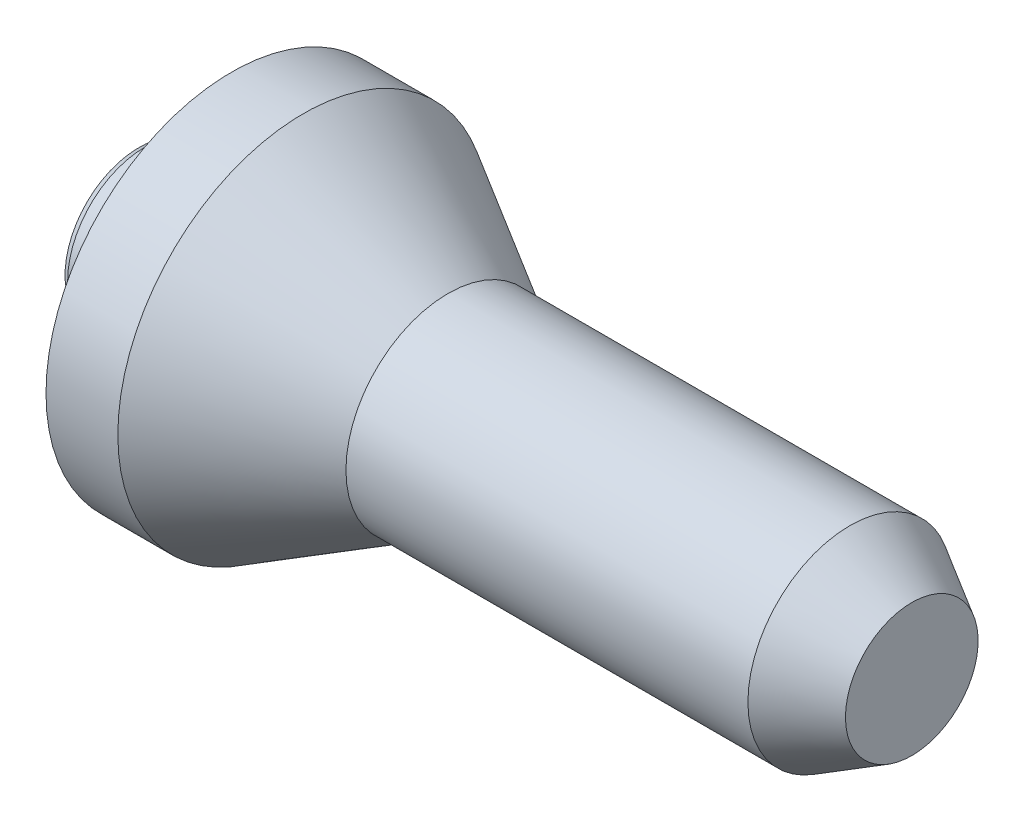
from build123d import *

# Parameters (mm, degrees)
TROU_TARAUD_M16_D           = 14
TROU_TARAUD_M16_DEPTH       = 45
TROU_TARAUD_M16_CSINK_D     = 16.5
TROU_TARAUD_M16_CSINK_ANGLE = 90
TROU_TARAUD_M16_TIP         = 4.206024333
CHANFREIN1_SIZE             = 1
CHANFREIN1_SIZE2            = 0.577350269


with BuildPart() as part:
    # Esquisse1 → R_volution1 (revolve)
    with BuildSketch(Plane.XY, mode=Mode.PRIVATE) as r_volution1_sk:
        Polygon((0, 0), (0, 12.5), (15, 12.5), (15, 30), (26.617314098, 30), (50, 16.5), (115, 16.5), (125, 10.726497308), (125, 0), align=None)
    revolve(r_volution1_sk.sketch.rotate(Axis((-16.465527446, 0, 0), (1, 0, 0)), 90), axis=Axis((-16.465527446, 0, 0), (1, 0, 0)))

    # Trou taraud_ M16
    with Locations(Plane.ZY):
        with Locations((0, 0)):
            CounterSinkHole(TROU_TARAUD_M16_D / 2, TROU_TARAUD_M16_CSINK_D / 2, depth=TROU_TARAUD_M16_DEPTH, counter_sink_angle=TROU_TARAUD_M16_CSINK_ANGLE)
            with Locations((0, 0, -(TROU_TARAUD_M16_DEPTH + TROU_TARAUD_M16_TIP / 2))):  # 118° drill point
                Cone(0, TROU_TARAUD_M16_D / 2, TROU_TARAUD_M16_TIP, mode=Mode.SUBTRACT)

    # Chanfrein1
    chanfrein1_edges = [part.edges().sort_by_distance(p)[0] for p in [
        (0, 0, -12.5),
    ]]
    chanfrein1_side = [part.faces().sort_by_distance(p)[0] for p in [
        (7.5, 0, -12.5),
    ]]
    chamfer(chanfrein1_edges, length=CHANFREIN1_SIZE, length2=CHANFREIN1_SIZE2, reference=chanfrein1_side[0])


solid = part.part
